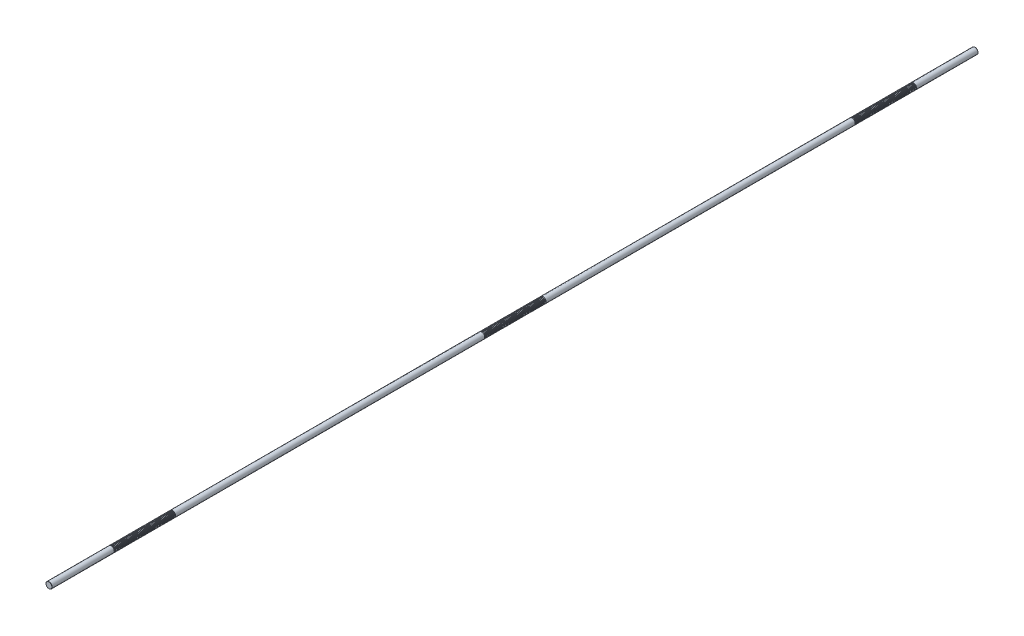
from build123d import *

# Parameters (mm, degrees)
SKETCH1_R           = 5
BOSS_EXTRUDE1_DEPTH = 750
CHAMFER1_SIZE       = 0.25
LPATTERN1_COUNT     = 50
LPATTERN1_PITCH     = 2
LPATTERN2_COUNT     = 3
LPATTERN2_PITCH     = 600


with BuildPart() as part:
    # Sketch1 → Boss-Extrude1 (new, symmetric)
    with BuildSketch(Plane.XY):
        Circle(SKETCH1_R)
    extrude(amount=BOSS_EXTRUDE1_DEPTH, both=True)

    # Chamfer1
    chamfer1_edges = [part.edges().sort_by_distance(p)[0] for p in [
        (-5, 0, -750),
        (-5, 0, 750),
    ]]
    chamfer(chamfer1_edges, length=CHAMFER1_SIZE)

    # Sketch2 → Cut-Revolve1 (revolve, cut)
    with BuildSketch(Plane(origin=(0, 0, 0), x_dir=(0, 0, -1), z_dir=(1, 0, 0)), mode=Mode.PRIVATE) as cut_revolve1_sk:
        Polygon((650.167468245, 5), (648.832531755, 5), (649.167468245, 3.75), (649.832531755, 3.75), align=None)
    cut_revolve1 = revolve(cut_revolve1_sk.sketch.rotate(Axis((0, 0, 750), (0, 0, -1)), 90), axis=Axis((0, 0, 750), (0, 0, -1)), mode=Mode.SUBTRACT)

    # LPattern1: Cut-Revolve1 ×50
    with Locations(*[(0, 0, i * LPATTERN1_PITCH) for i in range(1, LPATTERN1_COUNT)]):
        add(cut_revolve1, mode=Mode.SUBTRACT)

    # LPattern2: Cut-Revolve1 ×3
    with Locations(*[(0, 0, i * LPATTERN2_PITCH) for i in range(1, LPATTERN2_COUNT)]):
        add(cut_revolve1, mode=Mode.SUBTRACT)

    # LPattern2 copy 1 sketch → LPattern2 copy 1 (revolve, cut)
    with BuildSketch(Plane(origin=(0, 0, 602), x_dir=(0, 0, -1), z_dir=(1, 0, 0))):
        Polygon((650.167468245, 5), (648.832531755, 5), (649.167468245, 3.75), (649.832531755, 3.75), align=None)
    revolve(axis=Axis((0, 0, 1352), (0, 0, -1)), mode=Mode.SUBTRACT)

    # LPattern2 copy 2 sketch → LPattern2 copy 2 (revolve, cut)
    with BuildSketch(Plane(origin=(0, 0, 1202), x_dir=(0, 0, -1), z_dir=(1, 0, 0))):
        Polygon((650.167468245, 5), (648.832531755, 5), (649.167468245, 3.75), (649.832531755, 3.75), align=None)
    revolve(axis=Axis((0, 0, 1952), (0, 0, -1)), mode=Mode.SUBTRACT)

    # LPattern2 copy 3 sketch → LPattern2 copy 3 (revolve, cut)
    with BuildSketch(Plane(origin=(0, 0, 604), x_dir=(0, 0, -1), z_dir=(1, 0, 0))):
        Polygon((650.167468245, 5), (648.832531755, 5), (649.167468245, 3.75), (649.832531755, 3.75), align=None)
    revolve(axis=Axis((0, 0, 1354), (0, 0, -1)), mode=Mode.SUBTRACT)

    # LPattern2 copy 4 sketch → LPattern2 copy 4 (revolve, cut)
    with BuildSketch(Plane(origin=(0, 0, 1204), x_dir=(0, 0, -1), z_dir=(1, 0, 0))):
        Polygon((650.167468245, 5), (648.832531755, 5), (649.167468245, 3.75), (649.832531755, 3.75), align=None)
    revolve(axis=Axis((0, 0, 1954), (0, 0, -1)), mode=Mode.SUBTRACT)

    # LPattern2 copy 5 sketch → LPattern2 copy 5 (revolve, cut)
    with BuildSketch(Plane(origin=(0, 0, 606), x_dir=(0, 0, -1), z_dir=(1, 0, 0))):
        Polygon((650.167468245, 5), (648.832531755, 5), (649.167468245, 3.75), (649.832531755, 3.75), align=None)
    revolve(axis=Axis((0, 0, 1356), (0, 0, -1)), mode=Mode.SUBTRACT)

    # LPattern2 copy 6 sketch → LPattern2 copy 6 (revolve, cut)
    with BuildSketch(Plane(origin=(0, 0, 1206), x_dir=(0, 0, -1), z_dir=(1, 0, 0))):
        Polygon((650.167468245, 5), (648.832531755, 5), (649.167468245, 3.75), (649.832531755, 3.75), align=None)
    revolve(axis=Axis((0, 0, 1956), (0, 0, -1)), mode=Mode.SUBTRACT)

    # LPattern2 copy 7 sketch → LPattern2 copy 7 (revolve, cut)
    with BuildSketch(Plane(origin=(0, 0, 608), x_dir=(0, 0, -1), z_dir=(1, 0, 0))):
        Polygon((650.167468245, 5), (648.832531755, 5), (649.167468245, 3.75), (649.832531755, 3.75), align=None)
    revolve(axis=Axis((0, 0, 1358), (0, 0, -1)), mode=Mode.SUBTRACT)

    # LPattern2 copy 8 sketch → LPattern2 copy 8 (revolve, cut)
    with BuildSketch(Plane(origin=(0, 0, 1208), x_dir=(0, 0, -1), z_dir=(1, 0, 0))):
        Polygon((650.167468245, 5), (648.832531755, 5), (649.167468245, 3.75), (649.832531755, 3.75), align=None)
    revolve(axis=Axis((0, 0, 1958), (0, 0, -1)), mode=Mode.SUBTRACT)

    # LPattern2 copy 9 sketch → LPattern2 copy 9 (revolve, cut)
    with BuildSketch(Plane(origin=(0, 0, 610), x_dir=(0, 0, -1), z_dir=(1, 0, 0))):
        Polygon((650.167468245, 5), (648.832531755, 5), (649.167468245, 3.75), (649.832531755, 3.75), align=None)
    revolve(axis=Axis((0, 0, 1360), (0, 0, -1)), mode=Mode.SUBTRACT)

    # LPattern2 copy 10 sketch → LPattern2 copy 10 (revolve, cut)
    with BuildSketch(Plane(origin=(0, 0, 1210), x_dir=(0, 0, -1), z_dir=(1, 0, 0))):
        Polygon((650.167468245, 5), (648.832531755, 5), (649.167468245, 3.75), (649.832531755, 3.75), align=None)
    revolve(axis=Axis((0, 0, 1960), (0, 0, -1)), mode=Mode.SUBTRACT)

    # LPattern2 copy 11 sketch → LPattern2 copy 11 (revolve, cut)
    with BuildSketch(Plane(origin=(0, 0, 612), x_dir=(0, 0, -1), z_dir=(1, 0, 0))):
        Polygon((650.167468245, 5), (648.832531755, 5), (649.167468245, 3.75), (649.832531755, 3.75), align=None)
    revolve(axis=Axis((0, 0, 1362), (0, 0, -1)), mode=Mode.SUBTRACT)

    # LPattern2 copy 12 sketch → LPattern2 copy 12 (revolve, cut)
    with BuildSketch(Plane(origin=(0, 0, 1212), x_dir=(0, 0, -1), z_dir=(1, 0, 0))):
        Polygon((650.167468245, 5), (648.832531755, 5), (649.167468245, 3.75), (649.832531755, 3.75), align=None)
    revolve(axis=Axis((0, 0, 1962), (0, 0, -1)), mode=Mode.SUBTRACT)

    # LPattern2 copy 13 sketch → LPattern2 copy 13 (revolve, cut)
    with BuildSketch(Plane(origin=(0, 0, 614), x_dir=(0, 0, -1), z_dir=(1, 0, 0))):
        Polygon((650.167468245, 5), (648.832531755, 5), (649.167468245, 3.75), (649.832531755, 3.75), align=None)
    revolve(axis=Axis((0, 0, 1364), (0, 0, -1)), mode=Mode.SUBTRACT)

    # LPattern2 copy 14 sketch → LPattern2 copy 14 (revolve, cut)
    with BuildSketch(Plane(origin=(0, 0, 1214), x_dir=(0, 0, -1), z_dir=(1, 0, 0))):
        Polygon((650.167468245, 5), (648.832531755, 5), (649.167468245, 3.75), (649.832531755, 3.75), align=None)
    revolve(axis=Axis((0, 0, 1964), (0, 0, -1)), mode=Mode.SUBTRACT)

    # LPattern2 copy 15 sketch → LPattern2 copy 15 (revolve, cut)
    with BuildSketch(Plane(origin=(0, 0, 616), x_dir=(0, 0, -1), z_dir=(1, 0, 0))):
        Polygon((650.167468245, 5), (648.832531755, 5), (649.167468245, 3.75), (649.832531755, 3.75), align=None)
    revolve(axis=Axis((0, 0, 1366), (0, 0, -1)), mode=Mode.SUBTRACT)

    # LPattern2 copy 16 sketch → LPattern2 copy 16 (revolve, cut)
    with BuildSketch(Plane(origin=(0, 0, 1216), x_dir=(0, 0, -1), z_dir=(1, 0, 0))):
        Polygon((650.167468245, 5), (648.832531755, 5), (649.167468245, 3.75), (649.832531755, 3.75), align=None)
    revolve(axis=Axis((0, 0, 1966), (0, 0, -1)), mode=Mode.SUBTRACT)

    # LPattern2 copy 17 sketch → LPattern2 copy 17 (revolve, cut)
    with BuildSketch(Plane(origin=(0, 0, 618), x_dir=(0, 0, -1), z_dir=(1, 0, 0))):
        Polygon((650.167468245, 5), (648.832531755, 5), (649.167468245, 3.75), (649.832531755, 3.75), align=None)
    revolve(axis=Axis((0, 0, 1368), (0, 0, -1)), mode=Mode.SUBTRACT)

    # LPattern2 copy 18 sketch → LPattern2 copy 18 (revolve, cut)
    with BuildSketch(Plane(origin=(0, 0, 1218), x_dir=(0, 0, -1), z_dir=(1, 0, 0))):
        Polygon((650.167468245, 5), (648.832531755, 5), (649.167468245, 3.75), (649.832531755, 3.75), align=None)
    revolve(axis=Axis((0, 0, 1968), (0, 0, -1)), mode=Mode.SUBTRACT)

    # LPattern2 copy 19 sketch → LPattern2 copy 19 (revolve, cut)
    with BuildSketch(Plane(origin=(0, 0, 620), x_dir=(0, 0, -1), z_dir=(1, 0, 0))):
        Polygon((650.167468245, 5), (648.832531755, 5), (649.167468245, 3.75), (649.832531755, 3.75), align=None)
    revolve(axis=Axis((0, 0, 1370), (0, 0, -1)), mode=Mode.SUBTRACT)

    # LPattern2 copy 20 sketch → LPattern2 copy 20 (revolve, cut)
    with BuildSketch(Plane(origin=(0, 0, 1220), x_dir=(0, 0, -1), z_dir=(1, 0, 0))):
        Polygon((650.167468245, 5), (648.832531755, 5), (649.167468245, 3.75), (649.832531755, 3.75), align=None)
    revolve(axis=Axis((0, 0, 1970), (0, 0, -1)), mode=Mode.SUBTRACT)

    # LPattern2 copy 21 sketch → LPattern2 copy 21 (revolve, cut)
    with BuildSketch(Plane(origin=(0, 0, 622), x_dir=(0, 0, -1), z_dir=(1, 0, 0))):
        Polygon((650.167468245, 5), (648.832531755, 5), (649.167468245, 3.75), (649.832531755, 3.75), align=None)
    revolve(axis=Axis((0, 0, 1372), (0, 0, -1)), mode=Mode.SUBTRACT)

    # LPattern2 copy 22 sketch → LPattern2 copy 22 (revolve, cut)
    with BuildSketch(Plane(origin=(0, 0, 1222), x_dir=(0, 0, -1), z_dir=(1, 0, 0))):
        Polygon((650.167468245, 5), (648.832531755, 5), (649.167468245, 3.75), (649.832531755, 3.75), align=None)
    revolve(axis=Axis((0, 0, 1972), (0, 0, -1)), mode=Mode.SUBTRACT)

    # LPattern2 copy 23 sketch → LPattern2 copy 23 (revolve, cut)
    with BuildSketch(Plane(origin=(0, 0, 624), x_dir=(0, 0, -1), z_dir=(1, 0, 0))):
        Polygon((650.167468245, 5), (648.832531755, 5), (649.167468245, 3.75), (649.832531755, 3.75), align=None)
    revolve(axis=Axis((0, 0, 1374), (0, 0, -1)), mode=Mode.SUBTRACT)

    # LPattern2 copy 24 sketch → LPattern2 copy 24 (revolve, cut)
    with BuildSketch(Plane(origin=(0, 0, 1224), x_dir=(0, 0, -1), z_dir=(1, 0, 0))):
        Polygon((650.167468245, 5), (648.832531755, 5), (649.167468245, 3.75), (649.832531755, 3.75), align=None)
    revolve(axis=Axis((0, 0, 1974), (0, 0, -1)), mode=Mode.SUBTRACT)

    # LPattern2 copy 25 sketch → LPattern2 copy 25 (revolve, cut)
    with BuildSketch(Plane(origin=(0, 0, 626), x_dir=(0, 0, -1), z_dir=(1, 0, 0))):
        Polygon((650.167468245, 5), (648.832531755, 5), (649.167468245, 3.75), (649.832531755, 3.75), align=None)
    revolve(axis=Axis((0, 0, 1376), (0, 0, -1)), mode=Mode.SUBTRACT)

    # LPattern2 copy 26 sketch → LPattern2 copy 26 (revolve, cut)
    with BuildSketch(Plane(origin=(0, 0, 1226), x_dir=(0, 0, -1), z_dir=(1, 0, 0))):
        Polygon((650.167468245, 5), (648.832531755, 5), (649.167468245, 3.75), (649.832531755, 3.75), align=None)
    revolve(axis=Axis((0, 0, 1976), (0, 0, -1)), mode=Mode.SUBTRACT)

    # LPattern2 copy 27 sketch → LPattern2 copy 27 (revolve, cut)
    with BuildSketch(Plane(origin=(0, 0, 628), x_dir=(0, 0, -1), z_dir=(1, 0, 0))):
        Polygon((650.167468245, 5), (648.832531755, 5), (649.167468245, 3.75), (649.832531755, 3.75), align=None)
    revolve(axis=Axis((0, 0, 1378), (0, 0, -1)), mode=Mode.SUBTRACT)

    # LPattern2 copy 28 sketch → LPattern2 copy 28 (revolve, cut)
    with BuildSketch(Plane(origin=(0, 0, 1228), x_dir=(0, 0, -1), z_dir=(1, 0, 0))):
        Polygon((650.167468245, 5), (648.832531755, 5), (649.167468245, 3.75), (649.832531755, 3.75), align=None)
    revolve(axis=Axis((0, 0, 1978), (0, 0, -1)), mode=Mode.SUBTRACT)

    # LPattern2 copy 29 sketch → LPattern2 copy 29 (revolve, cut)
    with BuildSketch(Plane(origin=(0, 0, 630), x_dir=(0, 0, -1), z_dir=(1, 0, 0))):
        Polygon((650.167468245, 5), (648.832531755, 5), (649.167468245, 3.75), (649.832531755, 3.75), align=None)
    revolve(axis=Axis((0, 0, 1380), (0, 0, -1)), mode=Mode.SUBTRACT)

    # LPattern2 copy 30 sketch → LPattern2 copy 30 (revolve, cut)
    with BuildSketch(Plane(origin=(0, 0, 1230), x_dir=(0, 0, -1), z_dir=(1, 0, 0))):
        Polygon((650.167468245, 5), (648.832531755, 5), (649.167468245, 3.75), (649.832531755, 3.75), align=None)
    revolve(axis=Axis((0, 0, 1980), (0, 0, -1)), mode=Mode.SUBTRACT)

    # LPattern2 copy 31 sketch → LPattern2 copy 31 (revolve, cut)
    with BuildSketch(Plane(origin=(0, 0, 632), x_dir=(0, 0, -1), z_dir=(1, 0, 0))):
        Polygon((650.167468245, 5), (648.832531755, 5), (649.167468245, 3.75), (649.832531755, 3.75), align=None)
    revolve(axis=Axis((0, 0, 1382), (0, 0, -1)), mode=Mode.SUBTRACT)

    # LPattern2 copy 32 sketch → LPattern2 copy 32 (revolve, cut)
    with BuildSketch(Plane(origin=(0, 0, 1232), x_dir=(0, 0, -1), z_dir=(1, 0, 0))):
        Polygon((650.167468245, 5), (648.832531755, 5), (649.167468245, 3.75), (649.832531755, 3.75), align=None)
    revolve(axis=Axis((0, 0, 1982), (0, 0, -1)), mode=Mode.SUBTRACT)

    # LPattern2 copy 33 sketch → LPattern2 copy 33 (revolve, cut)
    with BuildSketch(Plane(origin=(0, 0, 634), x_dir=(0, 0, -1), z_dir=(1, 0, 0))):
        Polygon((650.167468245, 5), (648.832531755, 5), (649.167468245, 3.75), (649.832531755, 3.75), align=None)
    revolve(axis=Axis((0, 0, 1384), (0, 0, -1)), mode=Mode.SUBTRACT)

    # LPattern2 copy 34 sketch → LPattern2 copy 34 (revolve, cut)
    with BuildSketch(Plane(origin=(0, 0, 1234), x_dir=(0, 0, -1), z_dir=(1, 0, 0))):
        Polygon((650.167468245, 5), (648.832531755, 5), (649.167468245, 3.75), (649.832531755, 3.75), align=None)
    revolve(axis=Axis((0, 0, 1984), (0, 0, -1)), mode=Mode.SUBTRACT)

    # LPattern2 copy 35 sketch → LPattern2 copy 35 (revolve, cut)
    with BuildSketch(Plane(origin=(0, 0, 636), x_dir=(0, 0, -1), z_dir=(1, 0, 0))):
        Polygon((650.167468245, 5), (648.832531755, 5), (649.167468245, 3.75), (649.832531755, 3.75), align=None)
    revolve(axis=Axis((0, 0, 1386), (0, 0, -1)), mode=Mode.SUBTRACT)

    # LPattern2 copy 36 sketch → LPattern2 copy 36 (revolve, cut)
    with BuildSketch(Plane(origin=(0, 0, 1236), x_dir=(0, 0, -1), z_dir=(1, 0, 0))):
        Polygon((650.167468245, 5), (648.832531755, 5), (649.167468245, 3.75), (649.832531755, 3.75), align=None)
    revolve(axis=Axis((0, 0, 1986), (0, 0, -1)), mode=Mode.SUBTRACT)

    # LPattern2 copy 37 sketch → LPattern2 copy 37 (revolve, cut)
    with BuildSketch(Plane(origin=(0, 0, 638), x_dir=(0, 0, -1), z_dir=(1, 0, 0))):
        Polygon((650.167468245, 5), (648.832531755, 5), (649.167468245, 3.75), (649.832531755, 3.75), align=None)
    revolve(axis=Axis((0, 0, 1388), (0, 0, -1)), mode=Mode.SUBTRACT)

    # LPattern2 copy 38 sketch → LPattern2 copy 38 (revolve, cut)
    with BuildSketch(Plane(origin=(0, 0, 1238), x_dir=(0, 0, -1), z_dir=(1, 0, 0))):
        Polygon((650.167468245, 5), (648.832531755, 5), (649.167468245, 3.75), (649.832531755, 3.75), align=None)
    revolve(axis=Axis((0, 0, 1988), (0, 0, -1)), mode=Mode.SUBTRACT)

    # LPattern2 copy 39 sketch → LPattern2 copy 39 (revolve, cut)
    with BuildSketch(Plane(origin=(0, 0, 640), x_dir=(0, 0, -1), z_dir=(1, 0, 0))):
        Polygon((650.167468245, 5), (648.832531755, 5), (649.167468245, 3.75), (649.832531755, 3.75), align=None)
    revolve(axis=Axis((0, 0, 1390), (0, 0, -1)), mode=Mode.SUBTRACT)

    # LPattern2 copy 40 sketch → LPattern2 copy 40 (revolve, cut)
    with BuildSketch(Plane(origin=(0, 0, 1240), x_dir=(0, 0, -1), z_dir=(1, 0, 0))):
        Polygon((650.167468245, 5), (648.832531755, 5), (649.167468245, 3.75), (649.832531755, 3.75), align=None)
    revolve(axis=Axis((0, 0, 1990), (0, 0, -1)), mode=Mode.SUBTRACT)

    # LPattern2 copy 41 sketch → LPattern2 copy 41 (revolve, cut)
    with BuildSketch(Plane(origin=(0, 0, 642), x_dir=(0, 0, -1), z_dir=(1, 0, 0))):
        Polygon((650.167468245, 5), (648.832531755, 5), (649.167468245, 3.75), (649.832531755, 3.75), align=None)
    revolve(axis=Axis((0, 0, 1392), (0, 0, -1)), mode=Mode.SUBTRACT)

    # LPattern2 copy 42 sketch → LPattern2 copy 42 (revolve, cut)
    with BuildSketch(Plane(origin=(0, 0, 1242), x_dir=(0, 0, -1), z_dir=(1, 0, 0))):
        Polygon((650.167468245, 5), (648.832531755, 5), (649.167468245, 3.75), (649.832531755, 3.75), align=None)
    revolve(axis=Axis((0, 0, 1992), (0, 0, -1)), mode=Mode.SUBTRACT)

    # LPattern2 copy 43 sketch → LPattern2 copy 43 (revolve, cut)
    with BuildSketch(Plane(origin=(0, 0, 644), x_dir=(0, 0, -1), z_dir=(1, 0, 0))):
        Polygon((650.167468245, 5), (648.832531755, 5), (649.167468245, 3.75), (649.832531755, 3.75), align=None)
    revolve(axis=Axis((0, 0, 1394), (0, 0, -1)), mode=Mode.SUBTRACT)

    # LPattern2 copy 44 sketch → LPattern2 copy 44 (revolve, cut)
    with BuildSketch(Plane(origin=(0, 0, 1244), x_dir=(0, 0, -1), z_dir=(1, 0, 0))):
        Polygon((650.167468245, 5), (648.832531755, 5), (649.167468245, 3.75), (649.832531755, 3.75), align=None)
    revolve(axis=Axis((0, 0, 1994), (0, 0, -1)), mode=Mode.SUBTRACT)

    # LPattern2 copy 45 sketch → LPattern2 copy 45 (revolve, cut)
    with BuildSketch(Plane(origin=(0, 0, 646), x_dir=(0, 0, -1), z_dir=(1, 0, 0))):
        Polygon((650.167468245, 5), (648.832531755, 5), (649.167468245, 3.75), (649.832531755, 3.75), align=None)
    revolve(axis=Axis((0, 0, 1396), (0, 0, -1)), mode=Mode.SUBTRACT)

    # LPattern2 copy 46 sketch → LPattern2 copy 46 (revolve, cut)
    with BuildSketch(Plane(origin=(0, 0, 1246), x_dir=(0, 0, -1), z_dir=(1, 0, 0))):
        Polygon((650.167468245, 5), (648.832531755, 5), (649.167468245, 3.75), (649.832531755, 3.75), align=None)
    revolve(axis=Axis((0, 0, 1996), (0, 0, -1)), mode=Mode.SUBTRACT)

    # LPattern2 copy 47 sketch → LPattern2 copy 47 (revolve, cut)
    with BuildSketch(Plane(origin=(0, 0, 648), x_dir=(0, 0, -1), z_dir=(1, 0, 0))):
        Polygon((650.167468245, 5), (648.832531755, 5), (649.167468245, 3.75), (649.832531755, 3.75), align=None)
    revolve(axis=Axis((0, 0, 1398), (0, 0, -1)), mode=Mode.SUBTRACT)

    # LPattern2 copy 48 sketch → LPattern2 copy 48 (revolve, cut)
    with BuildSketch(Plane(origin=(0, 0, 1248), x_dir=(0, 0, -1), z_dir=(1, 0, 0))):
        Polygon((650.167468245, 5), (648.832531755, 5), (649.167468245, 3.75), (649.832531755, 3.75), align=None)
    revolve(axis=Axis((0, 0, 1998), (0, 0, -1)), mode=Mode.SUBTRACT)

    # LPattern2 copy 49 sketch → LPattern2 copy 49 (revolve, cut)
    with BuildSketch(Plane(origin=(0, 0, 650), x_dir=(0, 0, -1), z_dir=(1, 0, 0))):
        Polygon((650.167468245, 5), (648.832531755, 5), (649.167468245, 3.75), (649.832531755, 3.75), align=None)
    revolve(axis=Axis((0, 0, 1400), (0, 0, -1)), mode=Mode.SUBTRACT)

    # LPattern2 copy 50 sketch → LPattern2 copy 50 (revolve, cut)
    with BuildSketch(Plane(origin=(0, 0, 1250), x_dir=(0, 0, -1), z_dir=(1, 0, 0))):
        Polygon((650.167468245, 5), (648.832531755, 5), (649.167468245, 3.75), (649.832531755, 3.75), align=None)
    revolve(axis=Axis((0, 0, 2000), (0, 0, -1)), mode=Mode.SUBTRACT)

    # LPattern2 copy 51 sketch → LPattern2 copy 51 (revolve, cut)
    with BuildSketch(Plane(origin=(0, 0, 652), x_dir=(0, 0, -1), z_dir=(1, 0, 0))):
        Polygon((650.167468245, 5), (648.832531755, 5), (649.167468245, 3.75), (649.832531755, 3.75), align=None)
    revolve(axis=Axis((0, 0, 1402), (0, 0, -1)), mode=Mode.SUBTRACT)

    # LPattern2 copy 52 sketch → LPattern2 copy 52 (revolve, cut)
    with BuildSketch(Plane(origin=(0, 0, 1252), x_dir=(0, 0, -1), z_dir=(1, 0, 0))):
        Polygon((650.167468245, 5), (648.832531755, 5), (649.167468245, 3.75), (649.832531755, 3.75), align=None)
    revolve(axis=Axis((0, 0, 2002), (0, 0, -1)), mode=Mode.SUBTRACT)

    # LPattern2 copy 53 sketch → LPattern2 copy 53 (revolve, cut)
    with BuildSketch(Plane(origin=(0, 0, 654), x_dir=(0, 0, -1), z_dir=(1, 0, 0))):
        Polygon((650.167468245, 5), (648.832531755, 5), (649.167468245, 3.75), (649.832531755, 3.75), align=None)
    revolve(axis=Axis((0, 0, 1404), (0, 0, -1)), mode=Mode.SUBTRACT)

    # LPattern2 copy 54 sketch → LPattern2 copy 54 (revolve, cut)
    with BuildSketch(Plane(origin=(0, 0, 1254), x_dir=(0, 0, -1), z_dir=(1, 0, 0))):
        Polygon((650.167468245, 5), (648.832531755, 5), (649.167468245, 3.75), (649.832531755, 3.75), align=None)
    revolve(axis=Axis((0, 0, 2004), (0, 0, -1)), mode=Mode.SUBTRACT)

    # LPattern2 copy 55 sketch → LPattern2 copy 55 (revolve, cut)
    with BuildSketch(Plane(origin=(0, 0, 656), x_dir=(0, 0, -1), z_dir=(1, 0, 0))):
        Polygon((650.167468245, 5), (648.832531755, 5), (649.167468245, 3.75), (649.832531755, 3.75), align=None)
    revolve(axis=Axis((0, 0, 1406), (0, 0, -1)), mode=Mode.SUBTRACT)

    # LPattern2 copy 56 sketch → LPattern2 copy 56 (revolve, cut)
    with BuildSketch(Plane(origin=(0, 0, 1256), x_dir=(0, 0, -1), z_dir=(1, 0, 0))):
        Polygon((650.167468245, 5), (648.832531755, 5), (649.167468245, 3.75), (649.832531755, 3.75), align=None)
    revolve(axis=Axis((0, 0, 2006), (0, 0, -1)), mode=Mode.SUBTRACT)

    # LPattern2 copy 57 sketch → LPattern2 copy 57 (revolve, cut)
    with BuildSketch(Plane(origin=(0, 0, 658), x_dir=(0, 0, -1), z_dir=(1, 0, 0))):
        Polygon((650.167468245, 5), (648.832531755, 5), (649.167468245, 3.75), (649.832531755, 3.75), align=None)
    revolve(axis=Axis((0, 0, 1408), (0, 0, -1)), mode=Mode.SUBTRACT)

    # LPattern2 copy 58 sketch → LPattern2 copy 58 (revolve, cut)
    with BuildSketch(Plane(origin=(0, 0, 1258), x_dir=(0, 0, -1), z_dir=(1, 0, 0))):
        Polygon((650.167468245, 5), (648.832531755, 5), (649.167468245, 3.75), (649.832531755, 3.75), align=None)
    revolve(axis=Axis((0, 0, 2008), (0, 0, -1)), mode=Mode.SUBTRACT)

    # LPattern2 copy 59 sketch → LPattern2 copy 59 (revolve, cut)
    with BuildSketch(Plane(origin=(0, 0, 660), x_dir=(0, 0, -1), z_dir=(1, 0, 0))):
        Polygon((650.167468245, 5), (648.832531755, 5), (649.167468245, 3.75), (649.832531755, 3.75), align=None)
    revolve(axis=Axis((0, 0, 1410), (0, 0, -1)), mode=Mode.SUBTRACT)

    # LPattern2 copy 60 sketch → LPattern2 copy 60 (revolve, cut)
    with BuildSketch(Plane(origin=(0, 0, 1260), x_dir=(0, 0, -1), z_dir=(1, 0, 0))):
        Polygon((650.167468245, 5), (648.832531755, 5), (649.167468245, 3.75), (649.832531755, 3.75), align=None)
    revolve(axis=Axis((0, 0, 2010), (0, 0, -1)), mode=Mode.SUBTRACT)

    # LPattern2 copy 61 sketch → LPattern2 copy 61 (revolve, cut)
    with BuildSketch(Plane(origin=(0, 0, 662), x_dir=(0, 0, -1), z_dir=(1, 0, 0))):
        Polygon((650.167468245, 5), (648.832531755, 5), (649.167468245, 3.75), (649.832531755, 3.75), align=None)
    revolve(axis=Axis((0, 0, 1412), (0, 0, -1)), mode=Mode.SUBTRACT)

    # LPattern2 copy 62 sketch → LPattern2 copy 62 (revolve, cut)
    with BuildSketch(Plane(origin=(0, 0, 1262), x_dir=(0, 0, -1), z_dir=(1, 0, 0))):
        Polygon((650.167468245, 5), (648.832531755, 5), (649.167468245, 3.75), (649.832531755, 3.75), align=None)
    revolve(axis=Axis((0, 0, 2012), (0, 0, -1)), mode=Mode.SUBTRACT)

    # LPattern2 copy 63 sketch → LPattern2 copy 63 (revolve, cut)
    with BuildSketch(Plane(origin=(0, 0, 664), x_dir=(0, 0, -1), z_dir=(1, 0, 0))):
        Polygon((650.167468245, 5), (648.832531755, 5), (649.167468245, 3.75), (649.832531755, 3.75), align=None)
    revolve(axis=Axis((0, 0, 1414), (0, 0, -1)), mode=Mode.SUBTRACT)

    # LPattern2 copy 64 sketch → LPattern2 copy 64 (revolve, cut)
    with BuildSketch(Plane(origin=(0, 0, 1264), x_dir=(0, 0, -1), z_dir=(1, 0, 0))):
        Polygon((650.167468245, 5), (648.832531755, 5), (649.167468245, 3.75), (649.832531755, 3.75), align=None)
    revolve(axis=Axis((0, 0, 2014), (0, 0, -1)), mode=Mode.SUBTRACT)

    # LPattern2 copy 65 sketch → LPattern2 copy 65 (revolve, cut)
    with BuildSketch(Plane(origin=(0, 0, 666), x_dir=(0, 0, -1), z_dir=(1, 0, 0))):
        Polygon((650.167468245, 5), (648.832531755, 5), (649.167468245, 3.75), (649.832531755, 3.75), align=None)
    revolve(axis=Axis((0, 0, 1416), (0, 0, -1)), mode=Mode.SUBTRACT)

    # LPattern2 copy 66 sketch → LPattern2 copy 66 (revolve, cut)
    with BuildSketch(Plane(origin=(0, 0, 1266), x_dir=(0, 0, -1), z_dir=(1, 0, 0))):
        Polygon((650.167468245, 5), (648.832531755, 5), (649.167468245, 3.75), (649.832531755, 3.75), align=None)
    revolve(axis=Axis((0, 0, 2016), (0, 0, -1)), mode=Mode.SUBTRACT)

    # LPattern2 copy 67 sketch → LPattern2 copy 67 (revolve, cut)
    with BuildSketch(Plane(origin=(0, 0, 668), x_dir=(0, 0, -1), z_dir=(1, 0, 0))):
        Polygon((650.167468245, 5), (648.832531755, 5), (649.167468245, 3.75), (649.832531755, 3.75), align=None)
    revolve(axis=Axis((0, 0, 1418), (0, 0, -1)), mode=Mode.SUBTRACT)

    # LPattern2 copy 68 sketch → LPattern2 copy 68 (revolve, cut)
    with BuildSketch(Plane(origin=(0, 0, 1268), x_dir=(0, 0, -1), z_dir=(1, 0, 0))):
        Polygon((650.167468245, 5), (648.832531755, 5), (649.167468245, 3.75), (649.832531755, 3.75), align=None)
    revolve(axis=Axis((0, 0, 2018), (0, 0, -1)), mode=Mode.SUBTRACT)

    # LPattern2 copy 69 sketch → LPattern2 copy 69 (revolve, cut)
    with BuildSketch(Plane(origin=(0, 0, 670), x_dir=(0, 0, -1), z_dir=(1, 0, 0))):
        Polygon((650.167468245, 5), (648.832531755, 5), (649.167468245, 3.75), (649.832531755, 3.75), align=None)
    revolve(axis=Axis((0, 0, 1420), (0, 0, -1)), mode=Mode.SUBTRACT)

    # LPattern2 copy 70 sketch → LPattern2 copy 70 (revolve, cut)
    with BuildSketch(Plane(origin=(0, 0, 1270), x_dir=(0, 0, -1), z_dir=(1, 0, 0))):
        Polygon((650.167468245, 5), (648.832531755, 5), (649.167468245, 3.75), (649.832531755, 3.75), align=None)
    revolve(axis=Axis((0, 0, 2020), (0, 0, -1)), mode=Mode.SUBTRACT)

    # LPattern2 copy 71 sketch → LPattern2 copy 71 (revolve, cut)
    with BuildSketch(Plane(origin=(0, 0, 672), x_dir=(0, 0, -1), z_dir=(1, 0, 0))):
        Polygon((650.167468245, 5), (648.832531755, 5), (649.167468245, 3.75), (649.832531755, 3.75), align=None)
    revolve(axis=Axis((0, 0, 1422), (0, 0, -1)), mode=Mode.SUBTRACT)

    # LPattern2 copy 72 sketch → LPattern2 copy 72 (revolve, cut)
    with BuildSketch(Plane(origin=(0, 0, 1272), x_dir=(0, 0, -1), z_dir=(1, 0, 0))):
        Polygon((650.167468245, 5), (648.832531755, 5), (649.167468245, 3.75), (649.832531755, 3.75), align=None)
    revolve(axis=Axis((0, 0, 2022), (0, 0, -1)), mode=Mode.SUBTRACT)

    # LPattern2 copy 73 sketch → LPattern2 copy 73 (revolve, cut)
    with BuildSketch(Plane(origin=(0, 0, 674), x_dir=(0, 0, -1), z_dir=(1, 0, 0))):
        Polygon((650.167468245, 5), (648.832531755, 5), (649.167468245, 3.75), (649.832531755, 3.75), align=None)
    revolve(axis=Axis((0, 0, 1424), (0, 0, -1)), mode=Mode.SUBTRACT)

    # LPattern2 copy 74 sketch → LPattern2 copy 74 (revolve, cut)
    with BuildSketch(Plane(origin=(0, 0, 1274), x_dir=(0, 0, -1), z_dir=(1, 0, 0))):
        Polygon((650.167468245, 5), (648.832531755, 5), (649.167468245, 3.75), (649.832531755, 3.75), align=None)
    revolve(axis=Axis((0, 0, 2024), (0, 0, -1)), mode=Mode.SUBTRACT)

    # LPattern2 copy 75 sketch → LPattern2 copy 75 (revolve, cut)
    with BuildSketch(Plane(origin=(0, 0, 676), x_dir=(0, 0, -1), z_dir=(1, 0, 0))):
        Polygon((650.167468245, 5), (648.832531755, 5), (649.167468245, 3.75), (649.832531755, 3.75), align=None)
    revolve(axis=Axis((0, 0, 1426), (0, 0, -1)), mode=Mode.SUBTRACT)

    # LPattern2 copy 76 sketch → LPattern2 copy 76 (revolve, cut)
    with BuildSketch(Plane(origin=(0, 0, 1276), x_dir=(0, 0, -1), z_dir=(1, 0, 0))):
        Polygon((650.167468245, 5), (648.832531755, 5), (649.167468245, 3.75), (649.832531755, 3.75), align=None)
    revolve(axis=Axis((0, 0, 2026), (0, 0, -1)), mode=Mode.SUBTRACT)

    # LPattern2 copy 77 sketch → LPattern2 copy 77 (revolve, cut)
    with BuildSketch(Plane(origin=(0, 0, 678), x_dir=(0, 0, -1), z_dir=(1, 0, 0))):
        Polygon((650.167468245, 5), (648.832531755, 5), (649.167468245, 3.75), (649.832531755, 3.75), align=None)
    revolve(axis=Axis((0, 0, 1428), (0, 0, -1)), mode=Mode.SUBTRACT)

    # LPattern2 copy 78 sketch → LPattern2 copy 78 (revolve, cut)
    with BuildSketch(Plane(origin=(0, 0, 1278), x_dir=(0, 0, -1), z_dir=(1, 0, 0))):
        Polygon((650.167468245, 5), (648.832531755, 5), (649.167468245, 3.75), (649.832531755, 3.75), align=None)
    revolve(axis=Axis((0, 0, 2028), (0, 0, -1)), mode=Mode.SUBTRACT)

    # LPattern2 copy 79 sketch → LPattern2 copy 79 (revolve, cut)
    with BuildSketch(Plane(origin=(0, 0, 680), x_dir=(0, 0, -1), z_dir=(1, 0, 0))):
        Polygon((650.167468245, 5), (648.832531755, 5), (649.167468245, 3.75), (649.832531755, 3.75), align=None)
    revolve(axis=Axis((0, 0, 1430), (0, 0, -1)), mode=Mode.SUBTRACT)

    # LPattern2 copy 80 sketch → LPattern2 copy 80 (revolve, cut)
    with BuildSketch(Plane(origin=(0, 0, 1280), x_dir=(0, 0, -1), z_dir=(1, 0, 0))):
        Polygon((650.167468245, 5), (648.832531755, 5), (649.167468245, 3.75), (649.832531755, 3.75), align=None)
    revolve(axis=Axis((0, 0, 2030), (0, 0, -1)), mode=Mode.SUBTRACT)

    # LPattern2 copy 81 sketch → LPattern2 copy 81 (revolve, cut)
    with BuildSketch(Plane(origin=(0, 0, 682), x_dir=(0, 0, -1), z_dir=(1, 0, 0))):
        Polygon((650.167468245, 5), (648.832531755, 5), (649.167468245, 3.75), (649.832531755, 3.75), align=None)
    revolve(axis=Axis((0, 0, 1432), (0, 0, -1)), mode=Mode.SUBTRACT)

    # LPattern2 copy 82 sketch → LPattern2 copy 82 (revolve, cut)
    with BuildSketch(Plane(origin=(0, 0, 1282), x_dir=(0, 0, -1), z_dir=(1, 0, 0))):
        Polygon((650.167468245, 5), (648.832531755, 5), (649.167468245, 3.75), (649.832531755, 3.75), align=None)
    revolve(axis=Axis((0, 0, 2032), (0, 0, -1)), mode=Mode.SUBTRACT)

    # LPattern2 copy 83 sketch → LPattern2 copy 83 (revolve, cut)
    with BuildSketch(Plane(origin=(0, 0, 684), x_dir=(0, 0, -1), z_dir=(1, 0, 0))):
        Polygon((650.167468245, 5), (648.832531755, 5), (649.167468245, 3.75), (649.832531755, 3.75), align=None)
    revolve(axis=Axis((0, 0, 1434), (0, 0, -1)), mode=Mode.SUBTRACT)

    # LPattern2 copy 84 sketch → LPattern2 copy 84 (revolve, cut)
    with BuildSketch(Plane(origin=(0, 0, 1284), x_dir=(0, 0, -1), z_dir=(1, 0, 0))):
        Polygon((650.167468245, 5), (648.832531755, 5), (649.167468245, 3.75), (649.832531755, 3.75), align=None)
    revolve(axis=Axis((0, 0, 2034), (0, 0, -1)), mode=Mode.SUBTRACT)

    # LPattern2 copy 85 sketch → LPattern2 copy 85 (revolve, cut)
    with BuildSketch(Plane(origin=(0, 0, 686), x_dir=(0, 0, -1), z_dir=(1, 0, 0))):
        Polygon((650.167468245, 5), (648.832531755, 5), (649.167468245, 3.75), (649.832531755, 3.75), align=None)
    revolve(axis=Axis((0, 0, 1436), (0, 0, -1)), mode=Mode.SUBTRACT)

    # LPattern2 copy 86 sketch → LPattern2 copy 86 (revolve, cut)
    with BuildSketch(Plane(origin=(0, 0, 1286), x_dir=(0, 0, -1), z_dir=(1, 0, 0))):
        Polygon((650.167468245, 5), (648.832531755, 5), (649.167468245, 3.75), (649.832531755, 3.75), align=None)
    revolve(axis=Axis((0, 0, 2036), (0, 0, -1)), mode=Mode.SUBTRACT)

    # LPattern2 copy 87 sketch → LPattern2 copy 87 (revolve, cut)
    with BuildSketch(Plane(origin=(0, 0, 688), x_dir=(0, 0, -1), z_dir=(1, 0, 0))):
        Polygon((650.167468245, 5), (648.832531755, 5), (649.167468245, 3.75), (649.832531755, 3.75), align=None)
    revolve(axis=Axis((0, 0, 1438), (0, 0, -1)), mode=Mode.SUBTRACT)

    # LPattern2 copy 88 sketch → LPattern2 copy 88 (revolve, cut)
    with BuildSketch(Plane(origin=(0, 0, 1288), x_dir=(0, 0, -1), z_dir=(1, 0, 0))):
        Polygon((650.167468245, 5), (648.832531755, 5), (649.167468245, 3.75), (649.832531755, 3.75), align=None)
    revolve(axis=Axis((0, 0, 2038), (0, 0, -1)), mode=Mode.SUBTRACT)

    # LPattern2 copy 89 sketch → LPattern2 copy 89 (revolve, cut)
    with BuildSketch(Plane(origin=(0, 0, 690), x_dir=(0, 0, -1), z_dir=(1, 0, 0))):
        Polygon((650.167468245, 5), (648.832531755, 5), (649.167468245, 3.75), (649.832531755, 3.75), align=None)
    revolve(axis=Axis((0, 0, 1440), (0, 0, -1)), mode=Mode.SUBTRACT)

    # LPattern2 copy 90 sketch → LPattern2 copy 90 (revolve, cut)
    with BuildSketch(Plane(origin=(0, 0, 1290), x_dir=(0, 0, -1), z_dir=(1, 0, 0))):
        Polygon((650.167468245, 5), (648.832531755, 5), (649.167468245, 3.75), (649.832531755, 3.75), align=None)
    revolve(axis=Axis((0, 0, 2040), (0, 0, -1)), mode=Mode.SUBTRACT)

    # LPattern2 copy 91 sketch → LPattern2 copy 91 (revolve, cut)
    with BuildSketch(Plane(origin=(0, 0, 692), x_dir=(0, 0, -1), z_dir=(1, 0, 0))):
        Polygon((650.167468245, 5), (648.832531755, 5), (649.167468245, 3.75), (649.832531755, 3.75), align=None)
    revolve(axis=Axis((0, 0, 1442), (0, 0, -1)), mode=Mode.SUBTRACT)

    # LPattern2 copy 92 sketch → LPattern2 copy 92 (revolve, cut)
    with BuildSketch(Plane(origin=(0, 0, 1292), x_dir=(0, 0, -1), z_dir=(1, 0, 0))):
        Polygon((650.167468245, 5), (648.832531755, 5), (649.167468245, 3.75), (649.832531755, 3.75), align=None)
    revolve(axis=Axis((0, 0, 2042), (0, 0, -1)), mode=Mode.SUBTRACT)

    # LPattern2 copy 93 sketch → LPattern2 copy 93 (revolve, cut)
    with BuildSketch(Plane(origin=(0, 0, 694), x_dir=(0, 0, -1), z_dir=(1, 0, 0))):
        Polygon((650.167468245, 5), (648.832531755, 5), (649.167468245, 3.75), (649.832531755, 3.75), align=None)
    revolve(axis=Axis((0, 0, 1444), (0, 0, -1)), mode=Mode.SUBTRACT)

    # LPattern2 copy 94 sketch → LPattern2 copy 94 (revolve, cut)
    with BuildSketch(Plane(origin=(0, 0, 1294), x_dir=(0, 0, -1), z_dir=(1, 0, 0))):
        Polygon((650.167468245, 5), (648.832531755, 5), (649.167468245, 3.75), (649.832531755, 3.75), align=None)
    revolve(axis=Axis((0, 0, 2044), (0, 0, -1)), mode=Mode.SUBTRACT)

    # LPattern2 copy 95 sketch → LPattern2 copy 95 (revolve, cut)
    with BuildSketch(Plane(origin=(0, 0, 696), x_dir=(0, 0, -1), z_dir=(1, 0, 0))):
        Polygon((650.167468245, 5), (648.832531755, 5), (649.167468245, 3.75), (649.832531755, 3.75), align=None)
    revolve(axis=Axis((0, 0, 1446), (0, 0, -1)), mode=Mode.SUBTRACT)

    # LPattern2 copy 96 sketch → LPattern2 copy 96 (revolve, cut)
    with BuildSketch(Plane(origin=(0, 0, 1296), x_dir=(0, 0, -1), z_dir=(1, 0, 0))):
        Polygon((650.167468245, 5), (648.832531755, 5), (649.167468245, 3.75), (649.832531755, 3.75), align=None)
    revolve(axis=Axis((0, 0, 2046), (0, 0, -1)), mode=Mode.SUBTRACT)

    # LPattern2 copy 97 sketch → LPattern2 copy 97 (revolve, cut)
    with BuildSketch(Plane(origin=(0, 0, 698), x_dir=(0, 0, -1), z_dir=(1, 0, 0))):
        Polygon((650.167468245, 5), (648.832531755, 5), (649.167468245, 3.75), (649.832531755, 3.75), align=None)
    revolve(axis=Axis((0, 0, 1448), (0, 0, -1)), mode=Mode.SUBTRACT)

    # LPattern2 copy 98 sketch → LPattern2 copy 98 (revolve, cut)
    with BuildSketch(Plane(origin=(0, 0, 1298), x_dir=(0, 0, -1), z_dir=(1, 0, 0))):
        Polygon((650.167468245, 5), (648.832531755, 5), (649.167468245, 3.75), (649.832531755, 3.75), align=None)
    revolve(axis=Axis((0, 0, 2048), (0, 0, -1)), mode=Mode.SUBTRACT)


solid = part.part
